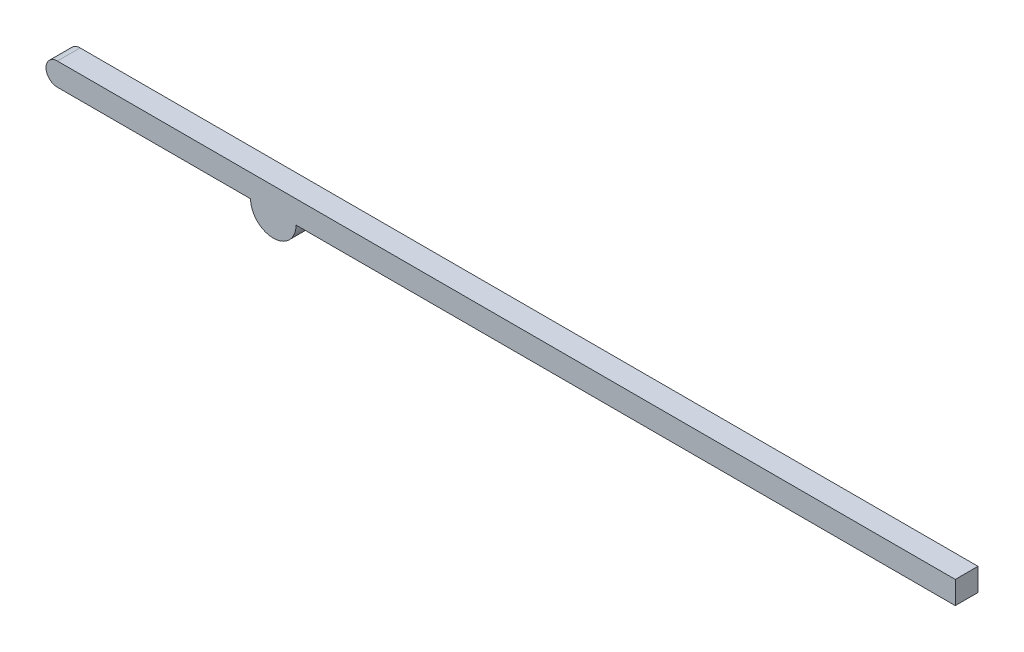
ISO-10303-21;
HEADER;
FILE_DESCRIPTION(('STEP AP214'),'2;1');
FILE_NAME('part.step','',(''),(''),'','','');
FILE_SCHEMA(('AUTOMOTIVE_DESIGN { 1 0 10303 214 1 1 1 1 }'));
ENDSEC;
DATA;
#1=APPLICATION_CONTEXT('core data for automotive mechanical design processes');
#2=APPLICATION_PROTOCOL_DEFINITION('international standard','automotive_design',2000,#1);
#3=PRODUCT_CONTEXT('',#1,'mechanical');
#4=PRODUCT('Part','Part','',(#3));
#5=PRODUCT_RELATED_PRODUCT_CATEGORY('part','',(#4));
#6=PRODUCT_DEFINITION_FORMATION('','',#4);
#7=PRODUCT_DEFINITION_CONTEXT('part definition',#1,'design');
#8=PRODUCT_DEFINITION('design','',#6,#7);
#9=PRODUCT_DEFINITION_SHAPE('','',#8);
#10=(LENGTH_UNIT() NAMED_UNIT(*) SI_UNIT(.MILLI.,.METRE.));
#11=(NAMED_UNIT(*) PLANE_ANGLE_UNIT() SI_UNIT($,.RADIAN.));
#12=(NAMED_UNIT(*) SI_UNIT($,.STERADIAN.) SOLID_ANGLE_UNIT());
#13=UNCERTAINTY_MEASURE_WITH_UNIT(LENGTH_MEASURE(1.E-05),#10,'distance_accuracy_value','');
#14=(GEOMETRIC_REPRESENTATION_CONTEXT(3) GLOBAL_UNCERTAINTY_ASSIGNED_CONTEXT((#13)) GLOBAL_UNIT_ASSIGNED_CONTEXT((#10,
#11,#12)) REPRESENTATION_CONTEXT('',''));
#15=CARTESIAN_POINT('',(0.,0.,0.));
#16=DIRECTION('',(0.,0.,1.));
#17=DIRECTION('',(1.,0.,0.));
#18=AXIS2_PLACEMENT_3D('',#15,#16,#17);
#19=CARTESIAN_POINT('',(-97.5,0.,-2.5));
#20=DIRECTION('',(0.,0.,-1.));
#21=DIRECTION('',(-1.,0.,0.));
#22=AXIS2_PLACEMENT_3D('',#19,#20,#21);
#23=CYLINDRICAL_SURFACE('',#22,2.5);
#24=DIRECTION('',(0.,0.,-1.));
#25=VECTOR('',#24,1.);
#26=CARTESIAN_POINT('',(-97.5,2.49999999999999,2.5));
#27=LINE('',#26,#25);
#28=CARTESIAN_POINT('',(-97.5,2.49999999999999,-2.5));
#29=VERTEX_POINT('',#28);
#30=CARTESIAN_POINT('',(-97.5,2.49999999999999,2.5));
#31=VERTEX_POINT('',#30);
#32=EDGE_CURVE('E132',#29,#31,#27,.F.);
#33=ORIENTED_EDGE('',*,*,#32,.F.);
#34=CARTESIAN_POINT('',(-97.5,0.,-2.5));
#35=DIRECTION('',(0.,0.,1.));
#36=DIRECTION('',(1.,0.,0.));
#37=AXIS2_PLACEMENT_3D('',#34,#35,#36);
#38=CIRCLE('',#37,2.5);
#39=CARTESIAN_POINT('',(-97.5,-2.50000000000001,-2.5));
#40=VERTEX_POINT('',#39);
#41=EDGE_CURVE('E45',#40,#29,#38,.F.);
#42=ORIENTED_EDGE('',*,*,#41,.F.);
#43=DIRECTION('',(0.,0.,-1.));
#44=VECTOR('',#43,1.);
#45=CARTESIAN_POINT('',(-97.5,-2.50000000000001,2.5));
#46=LINE('',#45,#44);
#47=CARTESIAN_POINT('',(-97.5,-2.50000000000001,2.5));
#48=VERTEX_POINT('',#47);
#49=EDGE_CURVE('E135',#48,#40,#46,.T.);
#50=ORIENTED_EDGE('',*,*,#49,.F.);
#51=CARTESIAN_POINT('',(-97.5,0.,2.5));
#52=DIRECTION('',(0.,0.,1.));
#53=DIRECTION('',(1.,0.,0.));
#54=AXIS2_PLACEMENT_3D('',#51,#52,#53);
#55=CIRCLE('',#54,2.5);
#56=EDGE_CURVE('E11',#31,#48,#55,.T.);
#57=ORIENTED_EDGE('',*,*,#56,.F.);
#58=EDGE_LOOP('',(#33,#42,#50,#57));
#59=FACE_BOUND('',#58,.T.);
#60=ADVANCED_FACE('F37',(#59),#23,.T.);
#61=CARTESIAN_POINT('',(100.,-2.49999999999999,2.5));
#62=DIRECTION('',(0.,1.,0.));
#63=DIRECTION('',(-1.,0.,0.));
#64=AXIS2_PLACEMENT_3D('',#61,#62,#63);
#65=PLANE('',#64);
#66=DIRECTION('',(0.,0.,-1.));
#67=VECTOR('',#66,1.);
#68=CARTESIAN_POINT('',(-44.9999999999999,-2.50000000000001,2.5));
#69=LINE('',#68,#67);
#70=CARTESIAN_POINT('',(-44.9999999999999,-2.50000000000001,-2.5));
#71=VERTEX_POINT('',#70);
#72=CARTESIAN_POINT('',(-44.9999999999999,-2.50000000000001,2.5));
#73=VERTEX_POINT('',#72);
#74=EDGE_CURVE('E99',#71,#73,#69,.F.);
#75=ORIENTED_EDGE('',*,*,#74,.F.);
#76=DIRECTION('',(1.,0.,0.));
#77=VECTOR('',#76,1.);
#78=CARTESIAN_POINT('',(100.,-2.49999999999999,-2.5));
#79=LINE('',#78,#77);
#80=CARTESIAN_POINT('',(100.,-2.49999999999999,-2.5));
#81=VERTEX_POINT('',#80);
#82=EDGE_CURVE('E87',#71,#81,#79,.T.);
#83=ORIENTED_EDGE('',*,*,#82,.T.);
#84=DIRECTION('',(0.,0.,-1.));
#85=VECTOR('',#84,1.);
#86=CARTESIAN_POINT('',(100.,-2.49999999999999,2.5));
#87=LINE('',#86,#85);
#88=CARTESIAN_POINT('',(100.,-2.49999999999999,2.5));
#89=VERTEX_POINT('',#88);
#90=EDGE_CURVE('E130',#89,#81,#87,.T.);
#91=ORIENTED_EDGE('',*,*,#90,.F.);
#92=DIRECTION('',(1.,0.,0.));
#93=VECTOR('',#92,1.);
#94=CARTESIAN_POINT('',(100.,-2.49999999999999,2.5));
#95=LINE('',#94,#93);
#96=EDGE_CURVE('E103',#73,#89,#95,.T.);
#97=ORIENTED_EDGE('',*,*,#96,.F.);
#98=EDGE_LOOP('',(#75,#83,#91,#97));
#99=FACE_BOUND('',#98,.T.);
#100=ADVANCED_FACE('F102',(#99),#65,.F.);
#101=CARTESIAN_POINT('',(-55.,-2.50000000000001,2.5));
#102=VERTEX_POINT('',#101);
#103=EDGE_CURVE('E117',#48,#102,#95,.T.);
#104=ORIENTED_EDGE('',*,*,#103,.F.);
#105=ORIENTED_EDGE('',*,*,#49,.T.);
#106=CARTESIAN_POINT('',(-55.,-2.50000000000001,-2.5));
#107=VERTEX_POINT('',#106);
#108=EDGE_CURVE('E98',#40,#107,#79,.T.);
#109=ORIENTED_EDGE('',*,*,#108,.T.);
#110=DIRECTION('',(0.,0.,-1.));
#111=VECTOR('',#110,1.);
#112=CARTESIAN_POINT('',(-55.,-2.50000000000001,2.5));
#113=LINE('',#112,#111);
#114=EDGE_CURVE('E107',#102,#107,#113,.T.);
#115=ORIENTED_EDGE('',*,*,#114,.F.);
#116=EDGE_LOOP('',(#104,#105,#109,#115));
#117=FACE_BOUND('',#116,.T.);
#118=ADVANCED_FACE('F146',(#117),#65,.F.);
#119=CARTESIAN_POINT('',(100.,-2.49999999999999,2.5));
#120=DIRECTION('',(-1.,0.,0.));
#121=DIRECTION('',(0.,0.,1.));
#122=AXIS2_PLACEMENT_3D('',#119,#120,#121);
#123=PLANE('',#122);
#124=DIRECTION('',(0.,1.,0.));
#125=VECTOR('',#124,1.);
#126=CARTESIAN_POINT('',(100.,-2.49999999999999,-2.5));
#127=LINE('',#126,#125);
#128=CARTESIAN_POINT('',(100.,2.50000000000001,-2.5));
#129=VERTEX_POINT('',#128);
#130=EDGE_CURVE('E94',#81,#129,#127,.T.);
#131=ORIENTED_EDGE('',*,*,#130,.T.);
#132=DIRECTION('',(0.,0.,-1.));
#133=VECTOR('',#132,1.);
#134=CARTESIAN_POINT('',(100.,2.50000000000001,2.5));
#135=LINE('',#134,#133);
#136=CARTESIAN_POINT('',(100.,2.50000000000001,2.5));
#137=VERTEX_POINT('',#136);
#138=EDGE_CURVE('E122',#137,#129,#135,.T.);
#139=ORIENTED_EDGE('',*,*,#138,.F.);
#140=DIRECTION('',(0.,1.,0.));
#141=VECTOR('',#140,1.);
#142=CARTESIAN_POINT('',(100.,-2.49999999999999,2.5));
#143=LINE('',#142,#141);
#144=EDGE_CURVE('E119',#89,#137,#143,.T.);
#145=ORIENTED_EDGE('',*,*,#144,.F.);
#146=ORIENTED_EDGE('',*,*,#90,.T.);
#147=EDGE_LOOP('',(#131,#139,#145,#146));
#148=FACE_BOUND('',#147,.T.);
#149=ADVANCED_FACE('F142',(#148),#123,.F.);
#150=CARTESIAN_POINT('',(100.,2.50000000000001,2.5));
#151=DIRECTION('',(0.,-1.,0.));
#152=DIRECTION('',(1.,0.,0.));
#153=AXIS2_PLACEMENT_3D('',#150,#151,#152);
#154=PLANE('',#153);
#155=DIRECTION('',(-1.,0.,0.));
#156=VECTOR('',#155,1.);
#157=CARTESIAN_POINT('',(100.,2.50000000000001,-2.5));
#158=LINE('',#157,#156);
#159=EDGE_CURVE('E125',#129,#29,#158,.T.);
#160=ORIENTED_EDGE('',*,*,#159,.T.);
#161=ORIENTED_EDGE('',*,*,#32,.T.);
#162=DIRECTION('',(-1.,0.,0.));
#163=VECTOR('',#162,1.);
#164=CARTESIAN_POINT('',(100.,2.50000000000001,2.5));
#165=LINE('',#164,#163);
#166=EDGE_CURVE('E121',#137,#31,#165,.T.);
#167=ORIENTED_EDGE('',*,*,#166,.F.);
#168=ORIENTED_EDGE('',*,*,#138,.T.);
#169=EDGE_LOOP('',(#160,#161,#167,#168));
#170=FACE_BOUND('',#169,.T.);
#171=ADVANCED_FACE('F138',(#170),#154,.F.);
#172=CARTESIAN_POINT('',(0.,0.,2.5));
#173=DIRECTION('',(0.,0.,1.));
#174=DIRECTION('',(1.,0.,0.));
#175=AXIS2_PLACEMENT_3D('',#172,#173,#174);
#176=PLANE('',#175);
#177=ORIENTED_EDGE('',*,*,#166,.T.);
#178=ORIENTED_EDGE('',*,*,#56,.T.);
#179=ORIENTED_EDGE('',*,*,#103,.T.);
#180=CARTESIAN_POINT('',(-50.,-2.50000000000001,2.5));
#181=DIRECTION('',(0.,0.,1.));
#182=DIRECTION('',(1.,0.,0.));
#183=AXIS2_PLACEMENT_3D('',#180,#181,#182);
#184=CIRCLE('',#183,5.00000000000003);
#185=EDGE_CURVE('E112',#102,#73,#184,.T.);
#186=ORIENTED_EDGE('',*,*,#185,.T.);
#187=ORIENTED_EDGE('',*,*,#96,.T.);
#188=ORIENTED_EDGE('',*,*,#144,.T.);
#189=EDGE_LOOP('',(#177,#178,#179,#186,#187,#188));
#190=FACE_BOUND('',#189,.T.);
#191=ADVANCED_FACE('F143',(#190),#176,.T.);
#192=CARTESIAN_POINT('',(0.,0.,-2.5));
#193=DIRECTION('',(0.,0.,1.));
#194=DIRECTION('',(1.,0.,0.));
#195=AXIS2_PLACEMENT_3D('',#192,#193,#194);
#196=PLANE('',#195);
#197=ORIENTED_EDGE('',*,*,#108,.F.);
#198=ORIENTED_EDGE('',*,*,#41,.T.);
#199=ORIENTED_EDGE('',*,*,#159,.F.);
#200=ORIENTED_EDGE('',*,*,#130,.F.);
#201=ORIENTED_EDGE('',*,*,#82,.F.);
#202=CARTESIAN_POINT('',(-50.,-2.50000000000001,-2.5));
#203=DIRECTION('',(0.,0.,1.));
#204=DIRECTION('',(1.,0.,0.));
#205=AXIS2_PLACEMENT_3D('',#202,#203,#204);
#206=CIRCLE('',#205,5.00000000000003);
#207=EDGE_CURVE('E92',#107,#71,#206,.T.);
#208=ORIENTED_EDGE('',*,*,#207,.F.);
#209=EDGE_LOOP('',(#197,#198,#199,#200,#201,#208));
#210=FACE_BOUND('',#209,.T.);
#211=ADVANCED_FACE('F90',(#210),#196,.F.);
#212=CARTESIAN_POINT('',(-50.,-2.50000000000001,2.5));
#213=DIRECTION('',(0.,0.,-1.));
#214=DIRECTION('',(-1.,0.,0.));
#215=AXIS2_PLACEMENT_3D('',#212,#213,#214);
#216=CYLINDRICAL_SURFACE('',#215,5.00000000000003);
#217=ORIENTED_EDGE('',*,*,#207,.T.);
#218=ORIENTED_EDGE('',*,*,#74,.T.);
#219=ORIENTED_EDGE('',*,*,#185,.F.);
#220=ORIENTED_EDGE('',*,*,#114,.T.);
#221=EDGE_LOOP('',(#217,#218,#219,#220));
#222=FACE_BOUND('',#221,.T.);
#223=ADVANCED_FACE('F110',(#222),#216,.T.);
#224=CLOSED_SHELL('',(#60,#100,#118,#149,#171,#191,#211,#223));
#225=MANIFOLD_SOLID_BREP('B2',#224);
#226=ADVANCED_BREP_SHAPE_REPRESENTATION('',(#18,#225),#14);
#227=SHAPE_DEFINITION_REPRESENTATION(#9,#226);
ENDSEC;
END-ISO-10303-21;
